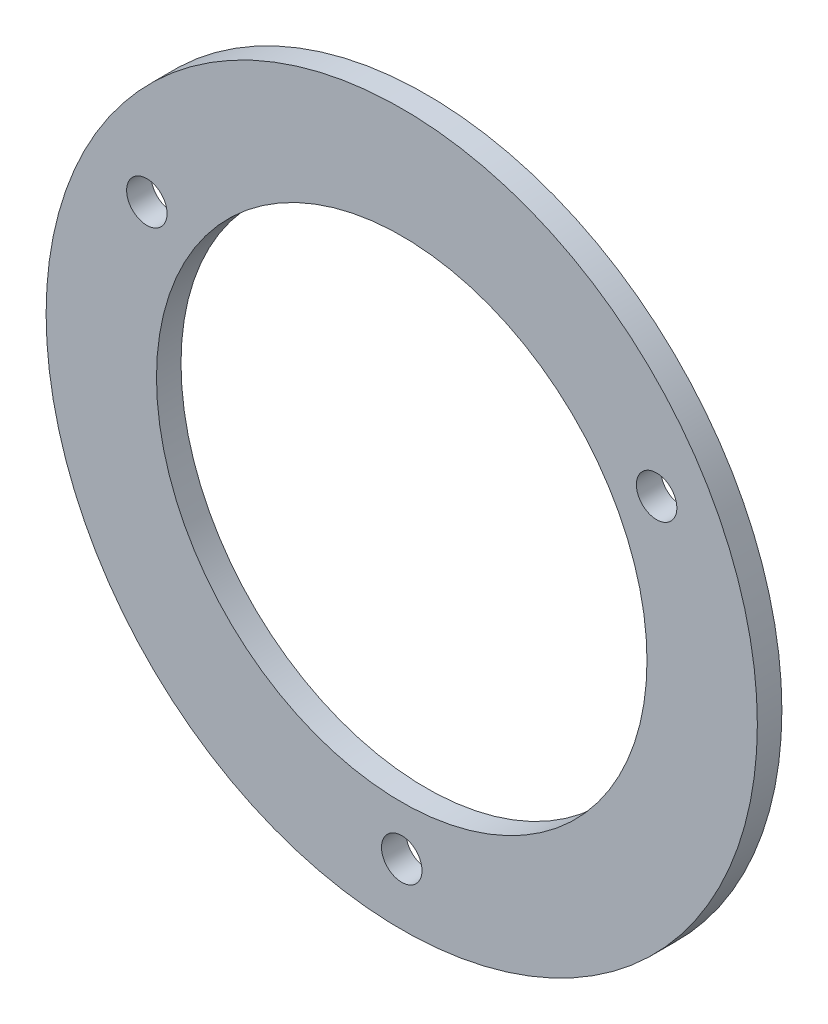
ISO-10303-21;
HEADER;
FILE_DESCRIPTION(('STEP AP214'),'2;1');
FILE_NAME('part.step','',(''),(''),'','','');
FILE_SCHEMA(('AUTOMOTIVE_DESIGN { 1 0 10303 214 1 1 1 1 }'));
ENDSEC;
DATA;
#1=APPLICATION_CONTEXT('core data for automotive mechanical design processes');
#2=APPLICATION_PROTOCOL_DEFINITION('international standard','automotive_design',2000,#1);
#3=PRODUCT_CONTEXT('',#1,'mechanical');
#4=PRODUCT('Part','Part','',(#3));
#5=PRODUCT_RELATED_PRODUCT_CATEGORY('part','',(#4));
#6=PRODUCT_DEFINITION_FORMATION('','',#4);
#7=PRODUCT_DEFINITION_CONTEXT('part definition',#1,'design');
#8=PRODUCT_DEFINITION('design','',#6,#7);
#9=PRODUCT_DEFINITION_SHAPE('','',#8);
#10=(LENGTH_UNIT() NAMED_UNIT(*) SI_UNIT(.MILLI.,.METRE.));
#11=(NAMED_UNIT(*) PLANE_ANGLE_UNIT() SI_UNIT($,.RADIAN.));
#12=(NAMED_UNIT(*) SI_UNIT($,.STERADIAN.) SOLID_ANGLE_UNIT());
#13=UNCERTAINTY_MEASURE_WITH_UNIT(LENGTH_MEASURE(1.E-05),#10,'distance_accuracy_value','');
#14=(GEOMETRIC_REPRESENTATION_CONTEXT(3) GLOBAL_UNCERTAINTY_ASSIGNED_CONTEXT((#13)) GLOBAL_UNIT_ASSIGNED_CONTEXT((#10,
#11,#12)) REPRESENTATION_CONTEXT('',''));
#15=CARTESIAN_POINT('',(0.,0.,0.));
#16=DIRECTION('',(0.,0.,1.));
#17=DIRECTION('',(1.,0.,0.));
#18=AXIS2_PLACEMENT_3D('',#15,#16,#17);
#19=CARTESIAN_POINT('',(-3.,52.,2.));
#20=DIRECTION('',(0.,0.,1.));
#21=DIRECTION('',(1.,0.,0.));
#22=AXIS2_PLACEMENT_3D('',#19,#20,#21);
#23=PLANE('',#22);
#24=CARTESIAN_POINT('',(17.7846096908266,63.9999999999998,2.));
#25=DIRECTION('',(0.,0.,1.));
#26=DIRECTION('',(1.,0.,0.));
#27=AXIS2_PLACEMENT_3D('',#24,#25,#26);
#28=CIRCLE('',#27,1.64999999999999);
#29=CARTESIAN_POINT('',(19.4346096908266,63.9999999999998,2.));
#30=VERTEX_POINT('',#29);
#31=EDGE_CURVE('E62',#30,#30,#28,.T.);
#32=ORIENTED_EDGE('',*,*,#31,.F.);
#33=EDGE_LOOP('',(#32));
#34=FACE_BOUND('',#33,.T.);
#35=CARTESIAN_POINT('',(-23.7846096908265,64.0000000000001,2.));
#36=DIRECTION('',(0.,0.,1.));
#37=DIRECTION('',(1.,0.,0.));
#38=AXIS2_PLACEMENT_3D('',#35,#36,#37);
#39=CIRCLE('',#38,1.64999999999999);
#40=CARTESIAN_POINT('',(-22.1346096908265,64.0000000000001,2.));
#41=VERTEX_POINT('',#40);
#42=EDGE_CURVE('E56',#41,#41,#39,.T.);
#43=ORIENTED_EDGE('',*,*,#42,.F.);
#44=EDGE_LOOP('',(#43));
#45=FACE_BOUND('',#44,.T.);
#46=CARTESIAN_POINT('',(-3.,28.,2.));
#47=DIRECTION('',(0.,0.,1.));
#48=DIRECTION('',(1.,0.,0.));
#49=AXIS2_PLACEMENT_3D('',#46,#47,#48);
#50=CIRCLE('',#49,1.64999999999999);
#51=CARTESIAN_POINT('',(-1.35000000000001,28.,2.));
#52=VERTEX_POINT('',#51);
#53=EDGE_CURVE('E50',#52,#52,#50,.T.);
#54=ORIENTED_EDGE('',*,*,#53,.F.);
#55=EDGE_LOOP('',(#54));
#56=FACE_BOUND('',#55,.T.);
#57=CARTESIAN_POINT('',(-3.,52.,2.));
#58=DIRECTION('',(0.,0.,1.));
#59=DIRECTION('',(1.,0.,0.));
#60=AXIS2_PLACEMENT_3D('',#57,#58,#59);
#61=CIRCLE('',#60,29.);
#62=CARTESIAN_POINT('',(26.,52.,2.));
#63=VERTEX_POINT('',#62);
#64=EDGE_CURVE('E10',#63,#63,#61,.T.);
#65=ORIENTED_EDGE('',*,*,#64,.T.);
#66=EDGE_LOOP('',(#65));
#67=FACE_BOUND('',#66,.T.);
#68=CARTESIAN_POINT('',(-3.,52.,2.));
#69=DIRECTION('',(0.,0.,1.));
#70=DIRECTION('',(1.,0.,0.));
#71=AXIS2_PLACEMENT_3D('',#68,#69,#70);
#72=CIRCLE('',#71,20.);
#73=CARTESIAN_POINT('',(17.,52.,2.));
#74=VERTEX_POINT('',#73);
#75=EDGE_CURVE('E40',#74,#74,#72,.T.);
#76=ORIENTED_EDGE('',*,*,#75,.F.);
#77=EDGE_LOOP('',(#76));
#78=FACE_BOUND('',#77,.T.);
#79=ADVANCED_FACE('F29',(#34,#45,#56,#67,#78),#23,.T.);
#80=CARTESIAN_POINT('',(-3.,52.,0.));
#81=DIRECTION('',(0.,0.,1.));
#82=DIRECTION('',(1.,0.,0.));
#83=AXIS2_PLACEMENT_3D('',#80,#81,#82);
#84=PLANE('',#83);
#85=CARTESIAN_POINT('',(17.7846096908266,63.9999999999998,0.));
#86=DIRECTION('',(0.,0.,1.));
#87=DIRECTION('',(1.,0.,0.));
#88=AXIS2_PLACEMENT_3D('',#85,#86,#87);
#89=CIRCLE('',#88,1.65);
#90=CARTESIAN_POINT('',(19.4346096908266,63.9999999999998,0.));
#91=VERTEX_POINT('',#90);
#92=EDGE_CURVE('E59',#91,#91,#89,.T.);
#93=ORIENTED_EDGE('',*,*,#92,.T.);
#94=EDGE_LOOP('',(#93));
#95=FACE_BOUND('',#94,.T.);
#96=CARTESIAN_POINT('',(-23.7846096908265,64.0000000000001,0.));
#97=DIRECTION('',(0.,0.,1.));
#98=DIRECTION('',(1.,0.,0.));
#99=AXIS2_PLACEMENT_3D('',#96,#97,#98);
#100=CIRCLE('',#99,1.65);
#101=CARTESIAN_POINT('',(-22.1346096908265,64.0000000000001,0.));
#102=VERTEX_POINT('',#101);
#103=EDGE_CURVE('E53',#102,#102,#100,.T.);
#104=ORIENTED_EDGE('',*,*,#103,.T.);
#105=EDGE_LOOP('',(#104));
#106=FACE_BOUND('',#105,.T.);
#107=CARTESIAN_POINT('',(-3.,28.,0.));
#108=DIRECTION('',(0.,0.,1.));
#109=DIRECTION('',(1.,0.,0.));
#110=AXIS2_PLACEMENT_3D('',#107,#108,#109);
#111=CIRCLE('',#110,1.65);
#112=CARTESIAN_POINT('',(-1.35,28.,0.));
#113=VERTEX_POINT('',#112);
#114=EDGE_CURVE('E45',#113,#113,#111,.T.);
#115=ORIENTED_EDGE('',*,*,#114,.T.);
#116=EDGE_LOOP('',(#115));
#117=FACE_BOUND('',#116,.T.);
#118=CARTESIAN_POINT('',(-3.,52.,0.));
#119=DIRECTION('',(0.,0.,1.));
#120=DIRECTION('',(1.,0.,0.));
#121=AXIS2_PLACEMENT_3D('',#118,#119,#120);
#122=CIRCLE('',#121,29.);
#123=CARTESIAN_POINT('',(26.,52.,0.));
#124=VERTEX_POINT('',#123);
#125=EDGE_CURVE('E33',#124,#124,#122,.T.);
#126=ORIENTED_EDGE('',*,*,#125,.F.);
#127=EDGE_LOOP('',(#126));
#128=FACE_BOUND('',#127,.T.);
#129=CARTESIAN_POINT('',(-3.,52.,0.));
#130=DIRECTION('',(0.,0.,1.));
#131=DIRECTION('',(1.,0.,0.));
#132=AXIS2_PLACEMENT_3D('',#129,#130,#131);
#133=CIRCLE('',#132,20.);
#134=CARTESIAN_POINT('',(17.,52.,0.));
#135=VERTEX_POINT('',#134);
#136=EDGE_CURVE('E42',#135,#135,#133,.T.);
#137=ORIENTED_EDGE('',*,*,#136,.T.);
#138=EDGE_LOOP('',(#137));
#139=FACE_BOUND('',#138,.T.);
#140=ADVANCED_FACE('F70',(#95,#106,#117,#128,#139),#84,.F.);
#141=CARTESIAN_POINT('',(-3.,52.,2.));
#142=DIRECTION('',(0.,0.,-1.));
#143=DIRECTION('',(-1.,0.,0.));
#144=AXIS2_PLACEMENT_3D('',#141,#142,#143);
#145=CYLINDRICAL_SURFACE('',#144,29.);
#146=ORIENTED_EDGE('',*,*,#64,.F.);
#147=EDGE_LOOP('',(#146));
#148=FACE_BOUND('',#147,.T.);
#149=ORIENTED_EDGE('',*,*,#125,.T.);
#150=EDGE_LOOP('',(#149));
#151=FACE_BOUND('',#150,.T.);
#152=ADVANCED_FACE('F31',(#148,#151),#145,.T.);
#153=CARTESIAN_POINT('',(-3.,52.,2.));
#154=DIRECTION('',(0.,0.,-1.));
#155=DIRECTION('',(-1.,0.,0.));
#156=AXIS2_PLACEMENT_3D('',#153,#154,#155);
#157=CYLINDRICAL_SURFACE('',#156,20.);
#158=ORIENTED_EDGE('',*,*,#75,.T.);
#159=EDGE_LOOP('',(#158));
#160=FACE_BOUND('',#159,.T.);
#161=ORIENTED_EDGE('',*,*,#136,.F.);
#162=EDGE_LOOP('',(#161));
#163=FACE_BOUND('',#162,.T.);
#164=ADVANCED_FACE('F78',(#160,#163),#157,.F.);
#165=CARTESIAN_POINT('',(-3.,28.,2.));
#166=DIRECTION('',(0.,0.,1.));
#167=DIRECTION('',(1.,0.,0.));
#168=AXIS2_PLACEMENT_3D('',#165,#166,#167);
#169=CYLINDRICAL_SURFACE('',#168,1.64999999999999);
#170=ORIENTED_EDGE('',*,*,#114,.F.);
#171=EDGE_LOOP('',(#170));
#172=FACE_BOUND('',#171,.T.);
#173=ORIENTED_EDGE('',*,*,#53,.T.);
#174=EDGE_LOOP('',(#173));
#175=FACE_BOUND('',#174,.T.);
#176=ADVANCED_FACE('F81',(#172,#175),#169,.F.);
#177=CARTESIAN_POINT('',(-23.7846096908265,64.0000000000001,2.));
#178=DIRECTION('',(0.,0.,1.));
#179=DIRECTION('',(1.,0.,0.));
#180=AXIS2_PLACEMENT_3D('',#177,#178,#179);
#181=CYLINDRICAL_SURFACE('',#180,1.64999999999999);
#182=ORIENTED_EDGE('',*,*,#103,.F.);
#183=EDGE_LOOP('',(#182));
#184=FACE_BOUND('',#183,.T.);
#185=ORIENTED_EDGE('',*,*,#42,.T.);
#186=EDGE_LOOP('',(#185));
#187=FACE_BOUND('',#186,.T.);
#188=ADVANCED_FACE('F95',(#184,#187),#181,.F.);
#189=CARTESIAN_POINT('',(17.7846096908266,63.9999999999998,2.));
#190=DIRECTION('',(0.,0.,1.));
#191=DIRECTION('',(1.,0.,0.));
#192=AXIS2_PLACEMENT_3D('',#189,#190,#191);
#193=CYLINDRICAL_SURFACE('',#192,1.64999999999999);
#194=ORIENTED_EDGE('',*,*,#92,.F.);
#195=EDGE_LOOP('',(#194));
#196=FACE_BOUND('',#195,.T.);
#197=ORIENTED_EDGE('',*,*,#31,.T.);
#198=EDGE_LOOP('',(#197));
#199=FACE_BOUND('',#198,.T.);
#200=ADVANCED_FACE('F66',(#196,#199),#193,.F.);
#201=CLOSED_SHELL('',(#79,#140,#152,#164,#176,#188,#200));
#202=MANIFOLD_SOLID_BREP('B2',#201);
#203=ADVANCED_BREP_SHAPE_REPRESENTATION('',(#18,#202),#14);
#204=SHAPE_DEFINITION_REPRESENTATION(#9,#203);
ENDSEC;
END-ISO-10303-21;
